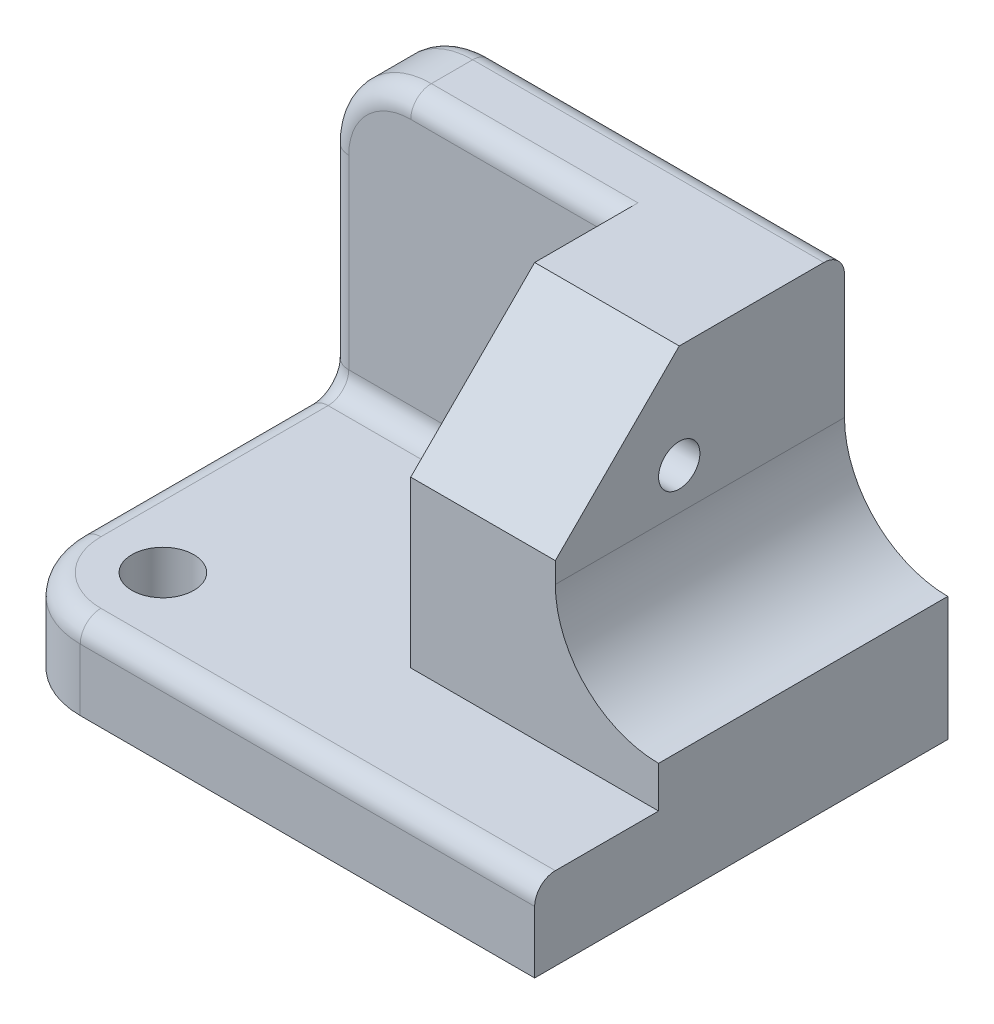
ISO-10303-21;
HEADER;
FILE_DESCRIPTION(('STEP AP214'),'2;1');
FILE_NAME('part.step','',(''),(''),'','','');
FILE_SCHEMA(('AUTOMOTIVE_DESIGN { 1 0 10303 214 1 1 1 1 }'));
ENDSEC;
DATA;
#1=APPLICATION_CONTEXT('core data for automotive mechanical design processes');
#2=APPLICATION_PROTOCOL_DEFINITION('international standard','automotive_design',2000,#1);
#3=PRODUCT_CONTEXT('',#1,'mechanical');
#4=PRODUCT('Part','Part','',(#3));
#5=PRODUCT_RELATED_PRODUCT_CATEGORY('part','',(#4));
#6=PRODUCT_DEFINITION_FORMATION('','',#4);
#7=PRODUCT_DEFINITION_CONTEXT('part definition',#1,'design');
#8=PRODUCT_DEFINITION('design','',#6,#7);
#9=PRODUCT_DEFINITION_SHAPE('','',#8);
#10=(LENGTH_UNIT() NAMED_UNIT(*) SI_UNIT(.MILLI.,.METRE.));
#11=(NAMED_UNIT(*) PLANE_ANGLE_UNIT() SI_UNIT($,.RADIAN.));
#12=(NAMED_UNIT(*) SI_UNIT($,.STERADIAN.) SOLID_ANGLE_UNIT());
#13=UNCERTAINTY_MEASURE_WITH_UNIT(LENGTH_MEASURE(1.E-05),#10,'distance_accuracy_value','');
#14=(GEOMETRIC_REPRESENTATION_CONTEXT(3) GLOBAL_UNCERTAINTY_ASSIGNED_CONTEXT((#13)) GLOBAL_UNIT_ASSIGNED_CONTEXT((#10,
#11,#12)) REPRESENTATION_CONTEXT('',''));
#15=CARTESIAN_POINT('',(0.,0.,0.));
#16=DIRECTION('',(0.,0.,1.));
#17=DIRECTION('',(1.,0.,0.));
#18=AXIS2_PLACEMENT_3D('',#15,#16,#17);
#19=CARTESIAN_POINT('',(0.,0.,0.));
#20=DIRECTION('',(0.,-1.,0.));
#21=DIRECTION('',(0.,0.,-1.));
#22=AXIS2_PLACEMENT_3D('',#19,#20,#21);
#23=PLANE('',#22);
#24=DIRECTION('',(0.,0.,1.));
#25=VECTOR('',#24,1.);
#26=CARTESIAN_POINT('',(-64.9999999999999,0.,50.));
#27=LINE('',#26,#25);
#28=CARTESIAN_POINT('',(-64.9999999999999,0.,-45.));
#29=VERTEX_POINT('',#28);
#30=CARTESIAN_POINT('',(-64.9999999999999,0.,30.));
#31=VERTEX_POINT('',#30);
#32=EDGE_CURVE('E307',#29,#31,#27,.T.);
#33=ORIENTED_EDGE('',*,*,#32,.F.);
#34=CARTESIAN_POINT('',(-59.9999999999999,0.,-45.));
#35=DIRECTION('',(0.,-1.,0.));
#36=DIRECTION('',(0.,0.,-1.));
#37=AXIS2_PLACEMENT_3D('',#34,#35,#36);
#38=CIRCLE('',#37,5.);
#39=CARTESIAN_POINT('',(-59.9999999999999,0.,-50.));
#40=VERTEX_POINT('',#39);
#41=EDGE_CURVE('E265',#29,#40,#38,.T.);
#42=ORIENTED_EDGE('',*,*,#41,.T.);
#43=DIRECTION('',(-1.,0.,0.));
#44=VECTOR('',#43,1.);
#45=CARTESIAN_POINT('',(-64.9999999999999,0.,-50.));
#46=LINE('',#45,#44);
#47=CARTESIAN_POINT('',(64.9999999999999,0.,-50.));
#48=VERTEX_POINT('',#47);
#49=EDGE_CURVE('E319',#48,#40,#46,.T.);
#50=ORIENTED_EDGE('',*,*,#49,.F.);
#51=DIRECTION('',(0.,0.,-1.));
#52=VECTOR('',#51,1.);
#53=CARTESIAN_POINT('',(64.9999999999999,0.,50.));
#54=LINE('',#53,#52);
#55=CARTESIAN_POINT('',(64.9999999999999,0.,50.));
#56=VERTEX_POINT('',#55);
#57=EDGE_CURVE('E219',#56,#48,#54,.T.);
#58=ORIENTED_EDGE('',*,*,#57,.F.);
#59=DIRECTION('',(1.,0.,0.));
#60=VECTOR('',#59,1.);
#61=CARTESIAN_POINT('',(-64.9999999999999,0.,50.));
#62=LINE('',#61,#60);
#63=CARTESIAN_POINT('',(-44.9999999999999,0.,50.));
#64=VERTEX_POINT('',#63);
#65=EDGE_CURVE('E228',#64,#56,#62,.T.);
#66=ORIENTED_EDGE('',*,*,#65,.F.);
#67=CARTESIAN_POINT('',(-44.9999999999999,0.,30.));
#68=DIRECTION('',(0.,-1.,0.));
#69=DIRECTION('',(0.,0.,-1.));
#70=AXIS2_PLACEMENT_3D('',#67,#68,#69);
#71=CIRCLE('',#70,20.);
#72=EDGE_CURVE('E317',#64,#31,#71,.T.);
#73=ORIENTED_EDGE('',*,*,#72,.T.);
#74=EDGE_LOOP('',(#33,#42,#50,#58,#66,#73));
#75=FACE_BOUND('',#74,.T.);
#76=CARTESIAN_POINT('',(-44.9999999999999,0.,30.));
#77=DIRECTION('',(0.,1.,0.));
#78=DIRECTION('',(0.,0.,1.));
#79=AXIS2_PLACEMENT_3D('',#76,#77,#78);
#80=CIRCLE('',#79,7.5);
#81=CARTESIAN_POINT('',(-44.9999999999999,0.,37.5));
#82=VERTEX_POINT('',#81);
#83=EDGE_CURVE('E674',#82,#82,#80,.T.);
#84=ORIENTED_EDGE('',*,*,#83,.T.);
#85=EDGE_LOOP('',(#84));
#86=FACE_BOUND('',#85,.T.);
#87=ADVANCED_FACE('F32',(#75,#86),#23,.T.);
#88=CARTESIAN_POINT('',(0.,20.,0.));
#89=DIRECTION('',(0.,-1.,0.));
#90=DIRECTION('',(0.,0.,-1.));
#91=AXIS2_PLACEMENT_3D('',#88,#89,#90);
#92=PLANE('',#91);
#93=CARTESIAN_POINT('',(-44.9999999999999,20.,30.));
#94=DIRECTION('',(0.,1.,0.));
#95=DIRECTION('',(0.,0.,1.));
#96=AXIS2_PLACEMENT_3D('',#93,#94,#95);
#97=CIRCLE('',#96,7.49999999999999);
#98=CARTESIAN_POINT('',(-44.9999999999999,20.,37.5));
#99=VERTEX_POINT('',#98);
#100=EDGE_CURVE('E289',#99,#99,#97,.T.);
#101=ORIENTED_EDGE('',*,*,#100,.F.);
#102=EDGE_LOOP('',(#101));
#103=FACE_BOUND('',#102,.T.);
#104=DIRECTION('',(0.,0.,-1.));
#105=VECTOR('',#104,1.);
#106=CARTESIAN_POINT('',(4.99999999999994,20.,20.));
#107=LINE('',#106,#105);
#108=CARTESIAN_POINT('',(4.99999999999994,20.,20.));
#109=VERTEX_POINT('',#108);
#110=CARTESIAN_POINT('',(4.99999999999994,20.,-25.));
#111=VERTEX_POINT('',#110);
#112=EDGE_CURVE('E213',#109,#111,#107,.T.);
#113=ORIENTED_EDGE('',*,*,#112,.T.);
#114=DIRECTION('',(1.,0.,0.));
#115=VECTOR('',#114,1.);
#116=CARTESIAN_POINT('',(-64.9999999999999,20.,-25.));
#117=LINE('',#116,#115);
#118=CARTESIAN_POINT('',(-59.9999999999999,20.,-25.));
#119=VERTEX_POINT('',#118);
#120=EDGE_CURVE('E237',#111,#119,#117,.F.);
#121=ORIENTED_EDGE('',*,*,#120,.T.);
#122=DIRECTION('',(0.,0.,1.));
#123=VECTOR('',#122,1.);
#124=CARTESIAN_POINT('',(-59.9999999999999,20.,0.));
#125=LINE('',#124,#123);
#126=CARTESIAN_POINT('',(-59.9999999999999,20.,30.));
#127=VERTEX_POINT('',#126);
#128=EDGE_CURVE('E235',#119,#127,#125,.T.);
#129=ORIENTED_EDGE('',*,*,#128,.T.);
#130=CARTESIAN_POINT('',(-44.9999999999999,20.,30.));
#131=DIRECTION('',(0.,-1.,0.));
#132=DIRECTION('',(0.,0.,-1.));
#133=AXIS2_PLACEMENT_3D('',#130,#131,#132);
#134=CIRCLE('',#133,15.);
#135=CARTESIAN_POINT('',(-44.9999999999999,20.,45.));
#136=VERTEX_POINT('',#135);
#137=EDGE_CURVE('E233',#127,#136,#134,.F.);
#138=ORIENTED_EDGE('',*,*,#137,.T.);
#139=DIRECTION('',(1.,0.,0.));
#140=VECTOR('',#139,1.);
#141=CARTESIAN_POINT('',(0.,20.,45.));
#142=LINE('',#141,#140);
#143=CARTESIAN_POINT('',(64.9999999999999,20.,45.));
#144=VERTEX_POINT('',#143);
#145=EDGE_CURVE('E231',#136,#144,#142,.T.);
#146=ORIENTED_EDGE('',*,*,#145,.T.);
#147=DIRECTION('',(0.,0.,-1.));
#148=VECTOR('',#147,1.);
#149=CARTESIAN_POINT('',(64.9999999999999,20.,50.));
#150=LINE('',#149,#148);
#151=CARTESIAN_POINT('',(64.9999999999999,20.,20.));
#152=VERTEX_POINT('',#151);
#153=EDGE_CURVE('E224',#144,#152,#150,.T.);
#154=ORIENTED_EDGE('',*,*,#153,.T.);
#155=DIRECTION('',(1.,0.,0.));
#156=VECTOR('',#155,1.);
#157=CARTESIAN_POINT('',(64.9999999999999,20.,20.));
#158=LINE('',#157,#156);
#159=EDGE_CURVE('E210',#109,#152,#158,.T.);
#160=ORIENTED_EDGE('',*,*,#159,.F.);
#161=EDGE_LOOP('',(#113,#121,#129,#138,#146,#154,#160));
#162=FACE_BOUND('',#161,.T.);
#163=ADVANCED_FACE('F366',(#103,#162),#92,.F.);
#164=CARTESIAN_POINT('',(-64.9999999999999,90.,-30.));
#165=DIRECTION('',(0.,0.,-1.));
#166=DIRECTION('',(-1.,0.,0.));
#167=AXIS2_PLACEMENT_3D('',#164,#165,#166);
#168=PLANE('',#167);
#169=DIRECTION('',(0.,-1.,0.));
#170=VECTOR('',#169,1.);
#171=CARTESIAN_POINT('',(-59.9999999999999,90.,-30.));
#172=LINE('',#171,#170);
#173=CARTESIAN_POINT('',(-59.9999999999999,70.,-30.));
#174=VERTEX_POINT('',#173);
#175=CARTESIAN_POINT('',(-59.9999999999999,25.,-30.));
#176=VERTEX_POINT('',#175);
#177=EDGE_CURVE('E353',#174,#176,#172,.T.);
#178=ORIENTED_EDGE('',*,*,#177,.T.);
#179=DIRECTION('',(1.,0.,0.));
#180=VECTOR('',#179,1.);
#181=CARTESIAN_POINT('',(4.99999999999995,25.,-30.));
#182=LINE('',#181,#180);
#183=CARTESIAN_POINT('',(4.99999999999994,25.,-30.));
#184=VERTEX_POINT('',#183);
#185=EDGE_CURVE('E354',#176,#184,#182,.T.);
#186=ORIENTED_EDGE('',*,*,#185,.T.);
#187=DIRECTION('',(0.,-1.,0.));
#188=VECTOR('',#187,1.);
#189=CARTESIAN_POINT('',(4.99999999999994,20.,-30.));
#190=LINE('',#189,#188);
#191=CARTESIAN_POINT('',(4.99999999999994,85.,-30.));
#192=VERTEX_POINT('',#191);
#193=EDGE_CURVE('E203',#192,#184,#190,.T.);
#194=ORIENTED_EDGE('',*,*,#193,.F.);
#195=DIRECTION('',(1.,0.,0.));
#196=VECTOR('',#195,1.);
#197=CARTESIAN_POINT('',(-44.9999999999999,85.,-30.));
#198=LINE('',#197,#196);
#199=CARTESIAN_POINT('',(-44.9999999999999,85.,-30.));
#200=VERTEX_POINT('',#199);
#201=EDGE_CURVE('E351',#192,#200,#198,.F.);
#202=ORIENTED_EDGE('',*,*,#201,.T.);
#203=CARTESIAN_POINT('',(-44.9999999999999,70.,-30.));
#204=DIRECTION('',(0.,0.,-1.));
#205=DIRECTION('',(-1.,0.,0.));
#206=AXIS2_PLACEMENT_3D('',#203,#204,#205);
#207=CIRCLE('',#206,15.);
#208=EDGE_CURVE('E346',#200,#174,#207,.F.);
#209=ORIENTED_EDGE('',*,*,#208,.T.);
#210=EDGE_LOOP('',(#178,#186,#194,#202,#209));
#211=FACE_BOUND('',#210,.T.);
#212=ADVANCED_FACE('F427',(#211),#168,.F.);
#213=CARTESIAN_POINT('',(64.9999999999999,20.,50.));
#214=DIRECTION('',(-1.,0.,0.));
#215=DIRECTION('',(0.,0.,1.));
#216=AXIS2_PLACEMENT_3D('',#213,#214,#215);
#217=PLANE('',#216);
#218=ORIENTED_EDGE('',*,*,#153,.F.);
#219=CARTESIAN_POINT('',(64.9999999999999,15.,45.));
#220=DIRECTION('',(-1.,0.,0.));
#221=DIRECTION('',(0.,0.,1.));
#222=AXIS2_PLACEMENT_3D('',#219,#220,#221);
#223=CIRCLE('',#222,5.);
#224=CARTESIAN_POINT('',(64.9999999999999,15.,50.));
#225=VERTEX_POINT('',#224);
#226=EDGE_CURVE('E49',#144,#225,#223,.F.);
#227=ORIENTED_EDGE('',*,*,#226,.T.);
#228=DIRECTION('',(0.,-1.,0.));
#229=VECTOR('',#228,1.);
#230=CARTESIAN_POINT('',(64.9999999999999,20.,50.));
#231=LINE('',#230,#229);
#232=EDGE_CURVE('E227',#225,#56,#231,.T.);
#233=ORIENTED_EDGE('',*,*,#232,.T.);
#234=ORIENTED_EDGE('',*,*,#57,.T.);
#235=DIRECTION('',(0.,-1.,0.));
#236=VECTOR('',#235,1.);
#237=CARTESIAN_POINT('',(64.9999999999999,20.,-50.));
#238=LINE('',#237,#236);
#239=CARTESIAN_POINT('',(64.9999999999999,30.,-50.));
#240=VERTEX_POINT('',#239);
#241=EDGE_CURVE('E325',#240,#48,#238,.T.);
#242=ORIENTED_EDGE('',*,*,#241,.F.);
#243=DIRECTION('',(0.,0.,1.));
#244=VECTOR('',#243,1.);
#245=CARTESIAN_POINT('',(64.9999999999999,30.,-50.));
#246=LINE('',#245,#244);
#247=CARTESIAN_POINT('',(64.9999999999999,30.,20.));
#248=VERTEX_POINT('',#247);
#249=EDGE_CURVE('E191',#240,#248,#246,.T.);
#250=ORIENTED_EDGE('',*,*,#249,.T.);
#251=DIRECTION('',(0.,1.,0.));
#252=VECTOR('',#251,1.);
#253=CARTESIAN_POINT('',(64.9999999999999,20.,20.));
#254=LINE('',#253,#252);
#255=EDGE_CURVE('E205',#152,#248,#254,.T.);
#256=ORIENTED_EDGE('',*,*,#255,.F.);
#257=EDGE_LOOP('',(#218,#227,#233,#234,#242,#250,#256));
#258=FACE_BOUND('',#257,.T.);
#259=ADVANCED_FACE('F388',(#258),#217,.F.);
#260=CARTESIAN_POINT('',(-64.9999999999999,20.,-50.));
#261=DIRECTION('',(0.,0.,1.));
#262=DIRECTION('',(1.,0.,0.));
#263=AXIS2_PLACEMENT_3D('',#260,#261,#262);
#264=PLANE('',#263);
#265=CARTESIAN_POINT('',(-44.9999999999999,70.,-50.));
#266=DIRECTION('',(0.,0.,1.));
#267=DIRECTION('',(1.,0.,0.));
#268=AXIS2_PLACEMENT_3D('',#265,#266,#267);
#269=CIRCLE('',#268,15.);
#270=CARTESIAN_POINT('',(-59.9999999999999,70.,-50.));
#271=VERTEX_POINT('',#270);
#272=CARTESIAN_POINT('',(-44.9999999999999,85.,-50.));
#273=VERTEX_POINT('',#272);
#274=EDGE_CURVE('E243',#271,#273,#269,.F.);
#275=ORIENTED_EDGE('',*,*,#274,.T.);
#276=DIRECTION('',(-1.,0.,0.));
#277=VECTOR('',#276,1.);
#278=CARTESIAN_POINT('',(39.9999999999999,85.,-50.));
#279=LINE('',#278,#277);
#280=CARTESIAN_POINT('',(39.9999999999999,85.,-50.));
#281=VERTEX_POINT('',#280);
#282=EDGE_CURVE('E179',#273,#281,#279,.F.);
#283=ORIENTED_EDGE('',*,*,#282,.T.);
#284=DIRECTION('',(0.,-1.,0.));
#285=VECTOR('',#284,1.);
#286=CARTESIAN_POINT('',(39.9999999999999,90.,-50.));
#287=LINE('',#286,#285);
#288=CARTESIAN_POINT('',(40.,55.,-50.));
#289=VERTEX_POINT('',#288);
#290=EDGE_CURVE('E171',#281,#289,#287,.T.);
#291=ORIENTED_EDGE('',*,*,#290,.T.);
#292=CARTESIAN_POINT('',(64.9999999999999,55.,-50.));
#293=DIRECTION('',(0.,0.,1.));
#294=DIRECTION('',(1.,0.,0.));
#295=AXIS2_PLACEMENT_3D('',#292,#293,#294);
#296=CIRCLE('',#295,25.);
#297=EDGE_CURVE('E176',#289,#240,#296,.T.);
#298=ORIENTED_EDGE('',*,*,#297,.T.);
#299=ORIENTED_EDGE('',*,*,#241,.T.);
#300=ORIENTED_EDGE('',*,*,#49,.T.);
#301=DIRECTION('',(0.,-1.,0.));
#302=VECTOR('',#301,1.);
#303=CARTESIAN_POINT('',(-59.9999999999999,20.,-50.));
#304=LINE('',#303,#302);
#305=EDGE_CURVE('E241',#40,#271,#304,.F.);
#306=ORIENTED_EDGE('',*,*,#305,.T.);
#307=EDGE_LOOP('',(#275,#283,#291,#298,#299,#300,#306));
#308=FACE_BOUND('',#307,.T.);
#309=ADVANCED_FACE('F174',(#308),#264,.F.);
#310=CARTESIAN_POINT('',(-64.9999999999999,20.,50.));
#311=DIRECTION('',(1.,0.,0.));
#312=DIRECTION('',(0.,0.,-1.));
#313=AXIS2_PLACEMENT_3D('',#310,#311,#312);
#314=PLANE('',#313);
#315=CARTESIAN_POINT('',(-64.9999999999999,25.,-25.));
#316=DIRECTION('',(1.,0.,0.));
#317=DIRECTION('',(0.,0.,-1.));
#318=AXIS2_PLACEMENT_3D('',#315,#316,#317);
#319=CIRCLE('',#318,10.);
#320=CARTESIAN_POINT('',(-64.9999999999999,25.,-35.));
#321=VERTEX_POINT('',#320);
#322=CARTESIAN_POINT('',(-64.9999999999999,15.,-25.));
#323=VERTEX_POINT('',#322);
#324=EDGE_CURVE('E252',#321,#323,#319,.F.);
#325=ORIENTED_EDGE('',*,*,#324,.F.);
#326=DIRECTION('',(0.,-1.,0.));
#327=VECTOR('',#326,1.);
#328=CARTESIAN_POINT('',(-64.9999999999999,20.,-35.));
#329=LINE('',#328,#327);
#330=CARTESIAN_POINT('',(-64.9999999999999,70.,-35.));
#331=VERTEX_POINT('',#330);
#332=EDGE_CURVE('E257',#321,#331,#329,.F.);
#333=ORIENTED_EDGE('',*,*,#332,.T.);
#334=DIRECTION('',(0.,0.,1.));
#335=VECTOR('',#334,1.);
#336=CARTESIAN_POINT('',(-64.9999999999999,70.,-50.));
#337=LINE('',#336,#335);
#338=CARTESIAN_POINT('',(-64.9999999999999,70.,-45.));
#339=VERTEX_POINT('',#338);
#340=EDGE_CURVE('E310',#331,#339,#337,.F.);
#341=ORIENTED_EDGE('',*,*,#340,.T.);
#342=DIRECTION('',(0.,-1.,0.));
#343=VECTOR('',#342,1.);
#344=CARTESIAN_POINT('',(-64.9999999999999,20.,-45.));
#345=LINE('',#344,#343);
#346=EDGE_CURVE('E250',#339,#29,#345,.T.);
#347=ORIENTED_EDGE('',*,*,#346,.T.);
#348=ORIENTED_EDGE('',*,*,#32,.T.);
#349=DIRECTION('',(0.,-1.,0.));
#350=VECTOR('',#349,1.);
#351=CARTESIAN_POINT('',(-64.9999999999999,20.,30.));
#352=LINE('',#351,#350);
#353=CARTESIAN_POINT('',(-64.9999999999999,15.,30.));
#354=VERTEX_POINT('',#353);
#355=EDGE_CURVE('E330',#31,#354,#352,.F.);
#356=ORIENTED_EDGE('',*,*,#355,.T.);
#357=DIRECTION('',(0.,0.,1.));
#358=VECTOR('',#357,1.);
#359=CARTESIAN_POINT('',(-64.9999999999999,15.,50.));
#360=LINE('',#359,#358);
#361=EDGE_CURVE('E255',#354,#323,#360,.F.);
#362=ORIENTED_EDGE('',*,*,#361,.T.);
#363=EDGE_LOOP('',(#325,#333,#341,#347,#348,#356,#362));
#364=FACE_BOUND('',#363,.T.);
#365=ADVANCED_FACE('F305',(#364),#314,.F.);
#366=CARTESIAN_POINT('',(-64.9999999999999,20.,50.));
#367=DIRECTION('',(0.,0.,-1.));
#368=DIRECTION('',(-1.,0.,0.));
#369=AXIS2_PLACEMENT_3D('',#366,#367,#368);
#370=PLANE('',#369);
#371=ORIENTED_EDGE('',*,*,#232,.F.);
#372=DIRECTION('',(1.,0.,0.));
#373=VECTOR('',#372,1.);
#374=CARTESIAN_POINT('',(-64.9999999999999,15.,50.));
#375=LINE('',#374,#373);
#376=CARTESIAN_POINT('',(-44.9999999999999,15.,50.));
#377=VERTEX_POINT('',#376);
#378=EDGE_CURVE('E41',#225,#377,#375,.F.);
#379=ORIENTED_EDGE('',*,*,#378,.T.);
#380=DIRECTION('',(0.,-1.,0.));
#381=VECTOR('',#380,1.);
#382=CARTESIAN_POINT('',(-44.9999999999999,20.,50.));
#383=LINE('',#382,#381);
#384=EDGE_CURVE('E333',#377,#64,#383,.T.);
#385=ORIENTED_EDGE('',*,*,#384,.T.);
#386=ORIENTED_EDGE('',*,*,#65,.T.);
#387=EDGE_LOOP('',(#371,#379,#385,#386));
#388=FACE_BOUND('',#387,.T.);
#389=ADVANCED_FACE('F408',(#388),#370,.F.);
#390=CARTESIAN_POINT('',(0.,90.,0.));
#391=DIRECTION('',(0.,1.,0.));
#392=DIRECTION('',(0.,0.,1.));
#393=AXIS2_PLACEMENT_3D('',#390,#391,#392);
#394=PLANE('',#393);
#395=DIRECTION('',(0.,0.,1.));
#396=VECTOR('',#395,1.);
#397=CARTESIAN_POINT('',(-44.9999999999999,90.,-30.));
#398=LINE('',#397,#396);
#399=CARTESIAN_POINT('',(-44.9999999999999,90.,-45.));
#400=VERTEX_POINT('',#399);
#401=CARTESIAN_POINT('',(-44.9999999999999,90.,-35.));
#402=VERTEX_POINT('',#401);
#403=EDGE_CURVE('E327',#400,#402,#398,.T.);
#404=ORIENTED_EDGE('',*,*,#403,.T.);
#405=DIRECTION('',(1.,0.,0.));
#406=VECTOR('',#405,1.);
#407=CARTESIAN_POINT('',(4.99999999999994,90.,-35.));
#408=LINE('',#407,#406);
#409=CARTESIAN_POINT('',(4.99999999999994,90.,-35.));
#410=VERTEX_POINT('',#409);
#411=EDGE_CURVE('E261',#402,#410,#408,.T.);
#412=ORIENTED_EDGE('',*,*,#411,.T.);
#413=DIRECTION('',(0.,0.,-1.));
#414=VECTOR('',#413,1.);
#415=CARTESIAN_POINT('',(4.99999999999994,90.,20.));
#416=LINE('',#415,#414);
#417=CARTESIAN_POINT('',(4.99999999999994,90.,-10.0000000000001));
#418=VERTEX_POINT('',#417);
#419=EDGE_CURVE('E56',#418,#410,#416,.T.);
#420=ORIENTED_EDGE('',*,*,#419,.F.);
#421=DIRECTION('',(1.,0.,0.));
#422=VECTOR('',#421,1.);
#423=CARTESIAN_POINT('',(0.,90.,-10.0000000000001));
#424=LINE('',#423,#422);
#425=CARTESIAN_POINT('',(39.9999999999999,90.,-10.0000000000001));
#426=VERTEX_POINT('',#425);
#427=EDGE_CURVE('E341',#418,#426,#424,.T.);
#428=ORIENTED_EDGE('',*,*,#427,.T.);
#429=DIRECTION('',(0.,0.,1.));
#430=VECTOR('',#429,1.);
#431=CARTESIAN_POINT('',(39.9999999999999,90.,-50.));
#432=LINE('',#431,#430);
#433=CARTESIAN_POINT('',(39.9999999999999,90.,-45.));
#434=VERTEX_POINT('',#433);
#435=EDGE_CURVE('E192',#434,#426,#432,.T.);
#436=ORIENTED_EDGE('',*,*,#435,.F.);
#437=DIRECTION('',(-1.,0.,0.));
#438=VECTOR('',#437,1.);
#439=CARTESIAN_POINT('',(-44.9999999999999,90.,-45.));
#440=LINE('',#439,#438);
#441=EDGE_CURVE('E259',#434,#400,#440,.T.);
#442=ORIENTED_EDGE('',*,*,#441,.T.);
#443=EDGE_LOOP('',(#404,#412,#420,#428,#436,#442));
#444=FACE_BOUND('',#443,.T.);
#445=ADVANCED_FACE('F395',(#444),#394,.T.);
#446=CARTESIAN_POINT('',(-44.9999999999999,70.,0.));
#447=DIRECTION('',(0.,0.,-1.));
#448=DIRECTION('',(-1.,0.,0.));
#449=AXIS2_PLACEMENT_3D('',#446,#447,#448);
#450=CYLINDRICAL_SURFACE('',#449,20.);
#451=ORIENTED_EDGE('',*,*,#403,.F.);
#452=CARTESIAN_POINT('',(-44.9999999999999,70.,-45.));
#453=DIRECTION('',(0.,0.,1.));
#454=DIRECTION('',(1.,0.,0.));
#455=AXIS2_PLACEMENT_3D('',#452,#453,#454);
#456=CIRCLE('',#455,20.);
#457=EDGE_CURVE('E248',#400,#339,#456,.T.);
#458=ORIENTED_EDGE('',*,*,#457,.T.);
#459=ORIENTED_EDGE('',*,*,#340,.F.);
#460=CARTESIAN_POINT('',(-44.9999999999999,70.,-35.));
#461=DIRECTION('',(0.,0.,-1.));
#462=DIRECTION('',(-1.,0.,0.));
#463=AXIS2_PLACEMENT_3D('',#460,#461,#462);
#464=CIRCLE('',#463,20.);
#465=EDGE_CURVE('E246',#331,#402,#464,.T.);
#466=ORIENTED_EDGE('',*,*,#465,.T.);
#467=EDGE_LOOP('',(#451,#458,#459,#466));
#468=FACE_BOUND('',#467,.T.);
#469=ADVANCED_FACE('F423',(#468),#450,.T.);
#470=CARTESIAN_POINT('',(-44.9999999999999,20.,30.));
#471=DIRECTION('',(0.,-1.,0.));
#472=DIRECTION('',(0.,0.,-1.));
#473=AXIS2_PLACEMENT_3D('',#470,#471,#472);
#474=CYLINDRICAL_SURFACE('',#473,20.);
#475=ORIENTED_EDGE('',*,*,#384,.F.);
#476=CARTESIAN_POINT('',(-44.9999999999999,15.,30.));
#477=DIRECTION('',(0.,-1.,0.));
#478=DIRECTION('',(0.,0.,-1.));
#479=AXIS2_PLACEMENT_3D('',#476,#477,#478);
#480=CIRCLE('',#479,20.);
#481=EDGE_CURVE('E239',#377,#354,#480,.T.);
#482=ORIENTED_EDGE('',*,*,#481,.T.);
#483=ORIENTED_EDGE('',*,*,#355,.F.);
#484=ORIENTED_EDGE('',*,*,#72,.F.);
#485=EDGE_LOOP('',(#475,#482,#483,#484));
#486=FACE_BOUND('',#485,.T.);
#487=ADVANCED_FACE('F411',(#486),#474,.T.);
#488=CARTESIAN_POINT('',(4.99999999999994,20.,20.));
#489=DIRECTION('',(1.,0.,0.));
#490=DIRECTION('',(0.,1.,0.));
#491=AXIS2_PLACEMENT_3D('',#488,#489,#490);
#492=PLANE('',#491);
#493=CARTESIAN_POINT('',(4.99999999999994,65.,-10.));
#494=DIRECTION('',(-1.,0.,0.));
#495=DIRECTION('',(0.,0.,1.));
#496=AXIS2_PLACEMENT_3D('',#493,#494,#495);
#497=CIRCLE('',#496,4.99999999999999);
#498=CARTESIAN_POINT('',(4.99999999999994,65.,-5.00000000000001));
#499=VERTEX_POINT('',#498);
#500=EDGE_CURVE('E349',#499,#499,#497,.T.);
#501=ORIENTED_EDGE('',*,*,#500,.F.);
#502=EDGE_LOOP('',(#501));
#503=FACE_BOUND('',#502,.T.);
#504=ORIENTED_EDGE('',*,*,#193,.T.);
#505=CARTESIAN_POINT('',(4.99999999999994,25.,-25.));
#506=DIRECTION('',(1.,0.,0.));
#507=DIRECTION('',(0.,1.,0.));
#508=AXIS2_PLACEMENT_3D('',#505,#506,#507);
#509=CIRCLE('',#508,5.);
#510=EDGE_CURVE('E229',#184,#111,#509,.F.);
#511=ORIENTED_EDGE('',*,*,#510,.T.);
#512=ORIENTED_EDGE('',*,*,#112,.F.);
#513=DIRECTION('',(0.,-1.,0.));
#514=VECTOR('',#513,1.);
#515=CARTESIAN_POINT('',(4.99999999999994,20.,20.));
#516=LINE('',#515,#514);
#517=CARTESIAN_POINT('',(4.99999999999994,60.0000000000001,20.));
#518=VERTEX_POINT('',#517);
#519=EDGE_CURVE('E208',#518,#109,#516,.T.);
#520=ORIENTED_EDGE('',*,*,#519,.F.);
#521=DIRECTION('',(0.,-0.707106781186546,0.707106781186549));
#522=VECTOR('',#521,1.);
#523=CARTESIAN_POINT('',(4.99999999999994,60.,20.));
#524=LINE('',#523,#522);
#525=EDGE_CURVE('E339',#518,#418,#524,.F.);
#526=ORIENTED_EDGE('',*,*,#525,.T.);
#527=ORIENTED_EDGE('',*,*,#419,.T.);
#528=CARTESIAN_POINT('',(4.99999999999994,85.,-35.));
#529=DIRECTION('',(1.,0.,0.));
#530=DIRECTION('',(0.,1.,0.));
#531=AXIS2_PLACEMENT_3D('',#528,#529,#530);
#532=CIRCLE('',#531,5.);
#533=EDGE_CURVE('E11',#410,#192,#532,.T.);
#534=ORIENTED_EDGE('',*,*,#533,.T.);
#535=EDGE_LOOP('',(#504,#511,#512,#520,#526,#527,#534));
#536=FACE_BOUND('',#535,.T.);
#537=ADVANCED_FACE('F360',(#503,#536),#492,.F.);
#538=CARTESIAN_POINT('',(0.,0.,20.));
#539=DIRECTION('',(0.,0.,1.));
#540=DIRECTION('',(1.,0.,0.));
#541=AXIS2_PLACEMENT_3D('',#538,#539,#540);
#542=PLANE('',#541);
#543=DIRECTION('',(0.,-1.,0.));
#544=VECTOR('',#543,1.);
#545=CARTESIAN_POINT('',(39.9999999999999,90.,20.));
#546=LINE('',#545,#544);
#547=CARTESIAN_POINT('',(40.,60.,20.));
#548=VERTEX_POINT('',#547);
#549=CARTESIAN_POINT('',(40.,55.,20.));
#550=VERTEX_POINT('',#549);
#551=EDGE_CURVE('E188',#548,#550,#546,.T.);
#552=ORIENTED_EDGE('',*,*,#551,.F.);
#553=DIRECTION('',(-1.,0.,0.));
#554=VECTOR('',#553,1.);
#555=CARTESIAN_POINT('',(0.,60.,20.));
#556=LINE('',#555,#554);
#557=EDGE_CURVE('E336',#548,#518,#556,.T.);
#558=ORIENTED_EDGE('',*,*,#557,.T.);
#559=ORIENTED_EDGE('',*,*,#519,.T.);
#560=ORIENTED_EDGE('',*,*,#159,.T.);
#561=ORIENTED_EDGE('',*,*,#255,.T.);
#562=CARTESIAN_POINT('',(64.9999999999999,55.,20.));
#563=DIRECTION('',(0.,0.,1.));
#564=DIRECTION('',(1.,0.,0.));
#565=AXIS2_PLACEMENT_3D('',#562,#563,#564);
#566=CIRCLE('',#565,25.);
#567=EDGE_CURVE('E182',#550,#248,#566,.T.);
#568=ORIENTED_EDGE('',*,*,#567,.F.);
#569=EDGE_LOOP('',(#552,#558,#559,#560,#561,#568));
#570=FACE_BOUND('',#569,.T.);
#571=ADVANCED_FACE('F390',(#570),#542,.T.);
#572=CARTESIAN_POINT('',(64.9999999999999,55.,-50.));
#573=DIRECTION('',(0.,0.,1.));
#574=DIRECTION('',(1.,0.,0.));
#575=AXIS2_PLACEMENT_3D('',#572,#573,#574);
#576=CYLINDRICAL_SURFACE('',#575,25.);
#577=ORIENTED_EDGE('',*,*,#567,.T.);
#578=ORIENTED_EDGE('',*,*,#249,.F.);
#579=ORIENTED_EDGE('',*,*,#297,.F.);
#580=DIRECTION('',(0.,0.,1.));
#581=VECTOR('',#580,1.);
#582=CARTESIAN_POINT('',(40.,55.,-50.));
#583=LINE('',#582,#581);
#584=EDGE_CURVE('E185',#289,#550,#583,.T.);
#585=ORIENTED_EDGE('',*,*,#584,.T.);
#586=EDGE_LOOP('',(#577,#578,#579,#585));
#587=FACE_BOUND('',#586,.T.);
#588=ADVANCED_FACE('F194',(#587),#576,.F.);
#589=CARTESIAN_POINT('',(39.9999999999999,90.,-50.));
#590=DIRECTION('',(-1.,0.,0.));
#591=DIRECTION('',(0.,-1.,0.));
#592=AXIS2_PLACEMENT_3D('',#589,#590,#591);
#593=PLANE('',#592);
#594=CARTESIAN_POINT('',(39.9999999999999,65.,-10.));
#595=DIRECTION('',(-1.,0.,0.));
#596=DIRECTION('',(0.,-1.,0.));
#597=AXIS2_PLACEMENT_3D('',#594,#595,#596);
#598=CIRCLE('',#597,4.99999999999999);
#599=CARTESIAN_POINT('',(39.9999999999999,60.,-10.));
#600=VERTEX_POINT('',#599);
#601=EDGE_CURVE('E201',#600,#600,#598,.T.);
#602=ORIENTED_EDGE('',*,*,#601,.T.);
#603=EDGE_LOOP('',(#602));
#604=FACE_BOUND('',#603,.T.);
#605=ORIENTED_EDGE('',*,*,#290,.F.);
#606=CARTESIAN_POINT('',(39.9999999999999,85.,-45.));
#607=DIRECTION('',(-1.,0.,0.));
#608=DIRECTION('',(0.,-1.,0.));
#609=AXIS2_PLACEMENT_3D('',#606,#607,#608);
#610=CIRCLE('',#609,5.);
#611=EDGE_CURVE('E263',#281,#434,#610,.F.);
#612=ORIENTED_EDGE('',*,*,#611,.T.);
#613=ORIENTED_EDGE('',*,*,#435,.T.);
#614=DIRECTION('',(0.,0.707106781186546,-0.707106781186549));
#615=VECTOR('',#614,1.);
#616=CARTESIAN_POINT('',(40.,60.,20.));
#617=LINE('',#616,#615);
#618=EDGE_CURVE('E344',#426,#548,#617,.F.);
#619=ORIENTED_EDGE('',*,*,#618,.T.);
#620=ORIENTED_EDGE('',*,*,#551,.T.);
#621=ORIENTED_EDGE('',*,*,#584,.F.);
#622=EDGE_LOOP('',(#605,#612,#613,#619,#620,#621));
#623=FACE_BOUND('',#622,.T.);
#624=ADVANCED_FACE('F186',(#604,#623),#593,.F.);
#625=CARTESIAN_POINT('',(0.,60.,20.));
#626=DIRECTION('',(0.,-0.707106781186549,-0.707106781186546));
#627=DIRECTION('',(-1.,0.,0.));
#628=AXIS2_PLACEMENT_3D('',#625,#626,#627);
#629=PLANE('',#628);
#630=ORIENTED_EDGE('',*,*,#618,.F.);
#631=ORIENTED_EDGE('',*,*,#427,.F.);
#632=ORIENTED_EDGE('',*,*,#525,.F.);
#633=ORIENTED_EDGE('',*,*,#557,.F.);
#634=EDGE_LOOP('',(#630,#631,#632,#633));
#635=FACE_BOUND('',#634,.T.);
#636=ADVANCED_FACE('F400',(#635),#629,.F.);
#637=CARTESIAN_POINT('',(4.99999999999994,65.,-10.));
#638=DIRECTION('',(-1.,0.,0.));
#639=DIRECTION('',(0.,0.,1.));
#640=AXIS2_PLACEMENT_3D('',#637,#638,#639);
#641=CYLINDRICAL_SURFACE('',#640,4.99999999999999);
#642=ORIENTED_EDGE('',*,*,#500,.T.);
#643=EDGE_LOOP('',(#642));
#644=FACE_BOUND('',#643,.T.);
#645=ORIENTED_EDGE('',*,*,#601,.F.);
#646=EDGE_LOOP('',(#645));
#647=FACE_BOUND('',#646,.T.);
#648=ADVANCED_FACE('F455',(#644,#647),#641,.F.);
#649=CARTESIAN_POINT('',(-44.9999999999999,20.,30.));
#650=DIRECTION('',(0.,1.,0.));
#651=DIRECTION('',(0.,0.,1.));
#652=AXIS2_PLACEMENT_3D('',#649,#650,#651);
#653=CYLINDRICAL_SURFACE('',#652,7.49999999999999);
#654=ORIENTED_EDGE('',*,*,#83,.F.);
#655=EDGE_LOOP('',(#654));
#656=FACE_BOUND('',#655,.T.);
#657=ORIENTED_EDGE('',*,*,#100,.T.);
#658=EDGE_LOOP('',(#657));
#659=FACE_BOUND('',#658,.T.);
#660=ADVANCED_FACE('F472',(#656,#659),#653,.F.);
#661=CARTESIAN_POINT('',(0.,15.,45.));
#662=DIRECTION('',(1.,0.,0.));
#663=DIRECTION('',(0.,0.,-1.));
#664=AXIS2_PLACEMENT_3D('',#661,#662,#663);
#665=CYLINDRICAL_SURFACE('',#664,5.);
#666=ORIENTED_EDGE('',*,*,#226,.F.);
#667=ORIENTED_EDGE('',*,*,#145,.F.);
#668=CARTESIAN_POINT('',(-44.9999999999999,15.,45.));
#669=DIRECTION('',(-1.,0.,0.));
#670=DIRECTION('',(0.,0.,1.));
#671=AXIS2_PLACEMENT_3D('',#668,#669,#670);
#672=CIRCLE('',#671,5.);
#673=EDGE_CURVE('E287',#377,#136,#672,.T.);
#674=ORIENTED_EDGE('',*,*,#673,.F.);
#675=ORIENTED_EDGE('',*,*,#378,.F.);
#676=EDGE_LOOP('',(#666,#667,#674,#675));
#677=FACE_BOUND('',#676,.T.);
#678=ADVANCED_FACE('F386',(#677),#665,.T.);
#679=CARTESIAN_POINT('',(0.,85.,-35.));
#680=DIRECTION('',(-1.,0.,0.));
#681=DIRECTION('',(0.,0.,1.));
#682=AXIS2_PLACEMENT_3D('',#679,#680,#681);
#683=CYLINDRICAL_SURFACE('',#682,5.);
#684=ORIENTED_EDGE('',*,*,#533,.F.);
#685=ORIENTED_EDGE('',*,*,#411,.F.);
#686=CARTESIAN_POINT('',(-44.9999999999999,85.,-35.));
#687=DIRECTION('',(-1.,0.,0.));
#688=DIRECTION('',(0.,0.,1.));
#689=AXIS2_PLACEMENT_3D('',#686,#687,#688);
#690=CIRCLE('',#689,5.);
#691=EDGE_CURVE('E284',#200,#402,#690,.T.);
#692=ORIENTED_EDGE('',*,*,#691,.F.);
#693=ORIENTED_EDGE('',*,*,#201,.F.);
#694=EDGE_LOOP('',(#684,#685,#692,#693));
#695=FACE_BOUND('',#694,.T.);
#696=ADVANCED_FACE('F425',(#695),#683,.T.);
#697=CARTESIAN_POINT('',(-44.9999999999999,15.,30.));
#698=DIRECTION('',(0.,-1.,0.));
#699=DIRECTION('',(0.,0.,-1.));
#700=AXIS2_PLACEMENT_3D('',#697,#698,#699);
#701=TOROIDAL_SURFACE('',#700,15.,5.);
#702=ORIENTED_EDGE('',*,*,#673,.T.);
#703=ORIENTED_EDGE('',*,*,#137,.F.);
#704=CARTESIAN_POINT('',(-59.9999999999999,15.,30.));
#705=DIRECTION('',(0.,0.,-1.));
#706=DIRECTION('',(-1.,0.,0.));
#707=AXIS2_PLACEMENT_3D('',#704,#705,#706);
#708=CIRCLE('',#707,5.);
#709=EDGE_CURVE('E281',#354,#127,#708,.T.);
#710=ORIENTED_EDGE('',*,*,#709,.F.);
#711=ORIENTED_EDGE('',*,*,#481,.F.);
#712=EDGE_LOOP('',(#702,#703,#710,#711));
#713=FACE_BOUND('',#712,.T.);
#714=ADVANCED_FACE('F381',(#713),#701,.T.);
#715=CARTESIAN_POINT('',(-44.9999999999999,70.,-35.));
#716=DIRECTION('',(0.,0.,-1.));
#717=DIRECTION('',(-1.,0.,0.));
#718=AXIS2_PLACEMENT_3D('',#715,#716,#717);
#719=TOROIDAL_SURFACE('',#718,15.,5.);
#720=ORIENTED_EDGE('',*,*,#691,.T.);
#721=ORIENTED_EDGE('',*,*,#465,.F.);
#722=CARTESIAN_POINT('',(-59.9999999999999,70.,-35.));
#723=DIRECTION('',(0.,-1.,0.));
#724=DIRECTION('',(0.,0.,-1.));
#725=AXIS2_PLACEMENT_3D('',#722,#723,#724);
#726=CIRCLE('',#725,5.);
#727=EDGE_CURVE('E278',#174,#331,#726,.T.);
#728=ORIENTED_EDGE('',*,*,#727,.F.);
#729=ORIENTED_EDGE('',*,*,#208,.F.);
#730=EDGE_LOOP('',(#720,#721,#728,#729));
#731=FACE_BOUND('',#730,.T.);
#732=ADVANCED_FACE('F420',(#731),#719,.T.);
#733=CARTESIAN_POINT('',(-59.9999999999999,15.,0.));
#734=DIRECTION('',(0.,0.,1.));
#735=DIRECTION('',(1.,0.,0.));
#736=AXIS2_PLACEMENT_3D('',#733,#734,#735);
#737=CYLINDRICAL_SURFACE('',#736,5.);
#738=ORIENTED_EDGE('',*,*,#709,.T.);
#739=ORIENTED_EDGE('',*,*,#128,.F.);
#740=CARTESIAN_POINT('',(-59.9999999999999,15.,-25.));
#741=DIRECTION('',(0.,0.,-1.));
#742=DIRECTION('',(-1.,0.,0.));
#743=AXIS2_PLACEMENT_3D('',#740,#741,#742);
#744=CIRCLE('',#743,5.);
#745=EDGE_CURVE('E275',#323,#119,#744,.T.);
#746=ORIENTED_EDGE('',*,*,#745,.F.);
#747=ORIENTED_EDGE('',*,*,#361,.F.);
#748=EDGE_LOOP('',(#738,#739,#746,#747));
#749=FACE_BOUND('',#748,.T.);
#750=ADVANCED_FACE('F376',(#749),#737,.T.);
#751=CARTESIAN_POINT('',(-59.9999999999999,90.,-35.));
#752=DIRECTION('',(0.,-1.,0.));
#753=DIRECTION('',(0.,0.,-1.));
#754=AXIS2_PLACEMENT_3D('',#751,#752,#753);
#755=CYLINDRICAL_SURFACE('',#754,5.);
#756=ORIENTED_EDGE('',*,*,#727,.T.);
#757=ORIENTED_EDGE('',*,*,#332,.F.);
#758=CARTESIAN_POINT('',(-59.9999999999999,25.,-35.));
#759=DIRECTION('',(0.,-1.,0.));
#760=DIRECTION('',(0.,0.,-1.));
#761=AXIS2_PLACEMENT_3D('',#758,#759,#760);
#762=CIRCLE('',#761,5.);
#763=EDGE_CURVE('E272',#176,#321,#762,.T.);
#764=ORIENTED_EDGE('',*,*,#763,.F.);
#765=ORIENTED_EDGE('',*,*,#177,.F.);
#766=EDGE_LOOP('',(#756,#757,#764,#765));
#767=FACE_BOUND('',#766,.T.);
#768=ADVANCED_FACE('F414',(#767),#755,.T.);
#769=CARTESIAN_POINT('',(-59.9999999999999,25.,-25.));
#770=DIRECTION('',(1.,0.,0.));
#771=DIRECTION('',(0.,0.,-1.));
#772=AXIS2_PLACEMENT_3D('',#769,#770,#771);
#773=TOROIDAL_SURFACE('',#772,10.,5.);
#774=ORIENTED_EDGE('',*,*,#324,.T.);
#775=ORIENTED_EDGE('',*,*,#745,.T.);
#776=CARTESIAN_POINT('',(-59.9999999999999,25.,-25.));
#777=DIRECTION('',(1.,0.,0.));
#778=DIRECTION('',(0.,0.,-1.));
#779=AXIS2_PLACEMENT_3D('',#776,#777,#778);
#780=CIRCLE('',#779,5.);
#781=EDGE_CURVE('E269',#176,#119,#780,.F.);
#782=ORIENTED_EDGE('',*,*,#781,.F.);
#783=ORIENTED_EDGE('',*,*,#763,.T.);
#784=EDGE_LOOP('',(#774,#775,#782,#783));
#785=FACE_BOUND('',#784,.T.);
#786=ADVANCED_FACE('F371',(#785),#773,.T.);
#787=CARTESIAN_POINT('',(-64.9999999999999,25.,-25.));
#788=DIRECTION('',(-1.,0.,0.));
#789=DIRECTION('',(0.,0.,1.));
#790=AXIS2_PLACEMENT_3D('',#787,#788,#789);
#791=CYLINDRICAL_SURFACE('',#790,5.);
#792=ORIENTED_EDGE('',*,*,#781,.T.);
#793=ORIENTED_EDGE('',*,*,#120,.F.);
#794=ORIENTED_EDGE('',*,*,#510,.F.);
#795=ORIENTED_EDGE('',*,*,#185,.F.);
#796=EDGE_LOOP('',(#792,#793,#794,#795));
#797=FACE_BOUND('',#796,.T.);
#798=ADVANCED_FACE('F368',(#797),#791,.F.);
#799=CARTESIAN_POINT('',(-59.9999999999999,20.,-45.));
#800=DIRECTION('',(0.,-1.,0.));
#801=DIRECTION('',(0.,0.,-1.));
#802=AXIS2_PLACEMENT_3D('',#799,#800,#801);
#803=CYLINDRICAL_SURFACE('',#802,5.);
#804=ORIENTED_EDGE('',*,*,#41,.F.);
#805=ORIENTED_EDGE('',*,*,#346,.F.);
#806=CARTESIAN_POINT('',(-59.9999999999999,70.,-45.));
#807=DIRECTION('',(0.,1.,0.));
#808=DIRECTION('',(0.,0.,1.));
#809=AXIS2_PLACEMENT_3D('',#806,#807,#808);
#810=CIRCLE('',#809,5.);
#811=EDGE_CURVE('E36',#271,#339,#810,.T.);
#812=ORIENTED_EDGE('',*,*,#811,.F.);
#813=ORIENTED_EDGE('',*,*,#305,.F.);
#814=EDGE_LOOP('',(#804,#805,#812,#813));
#815=FACE_BOUND('',#814,.T.);
#816=ADVANCED_FACE('F34',(#815),#803,.T.);
#817=CARTESIAN_POINT('',(0.,85.,-45.));
#818=DIRECTION('',(1.,0.,0.));
#819=DIRECTION('',(0.,0.,-1.));
#820=AXIS2_PLACEMENT_3D('',#817,#818,#819);
#821=CYLINDRICAL_SURFACE('',#820,5.);
#822=ORIENTED_EDGE('',*,*,#611,.F.);
#823=ORIENTED_EDGE('',*,*,#282,.F.);
#824=CARTESIAN_POINT('',(-44.9999999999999,85.,-45.));
#825=DIRECTION('',(-1.,0.,0.));
#826=DIRECTION('',(0.,0.,1.));
#827=AXIS2_PLACEMENT_3D('',#824,#825,#826);
#828=CIRCLE('',#827,5.);
#829=EDGE_CURVE('E290',#400,#273,#828,.T.);
#830=ORIENTED_EDGE('',*,*,#829,.F.);
#831=ORIENTED_EDGE('',*,*,#441,.F.);
#832=EDGE_LOOP('',(#822,#823,#830,#831));
#833=FACE_BOUND('',#832,.T.);
#834=ADVANCED_FACE('F404',(#833),#821,.T.);
#835=CARTESIAN_POINT('',(-44.9999999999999,70.,-45.));
#836=DIRECTION('',(0.,0.,1.));
#837=DIRECTION('',(1.,0.,0.));
#838=AXIS2_PLACEMENT_3D('',#835,#836,#837);
#839=TOROIDAL_SURFACE('',#838,15.,5.);
#840=ORIENTED_EDGE('',*,*,#811,.T.);
#841=ORIENTED_EDGE('',*,*,#457,.F.);
#842=ORIENTED_EDGE('',*,*,#829,.T.);
#843=ORIENTED_EDGE('',*,*,#274,.F.);
#844=EDGE_LOOP('',(#840,#841,#842,#843));
#845=FACE_BOUND('',#844,.T.);
#846=ADVANCED_FACE('F297',(#845),#839,.T.);
#847=CLOSED_SHELL('',(#87,#163,#212,#259,#309,#365,#389,#445,#469,#487,#537,#571,#588,#624,#636,
#648,#660,#678,#696,#714,#732,#750,#768,#786,#798,#816,#834,#846));
#848=MANIFOLD_SOLID_BREP('B2',#847);
#849=ADVANCED_BREP_SHAPE_REPRESENTATION('',(#18,#848),#14);
#850=SHAPE_DEFINITION_REPRESENTATION(#9,#849);
ENDSEC;
END-ISO-10303-21;
